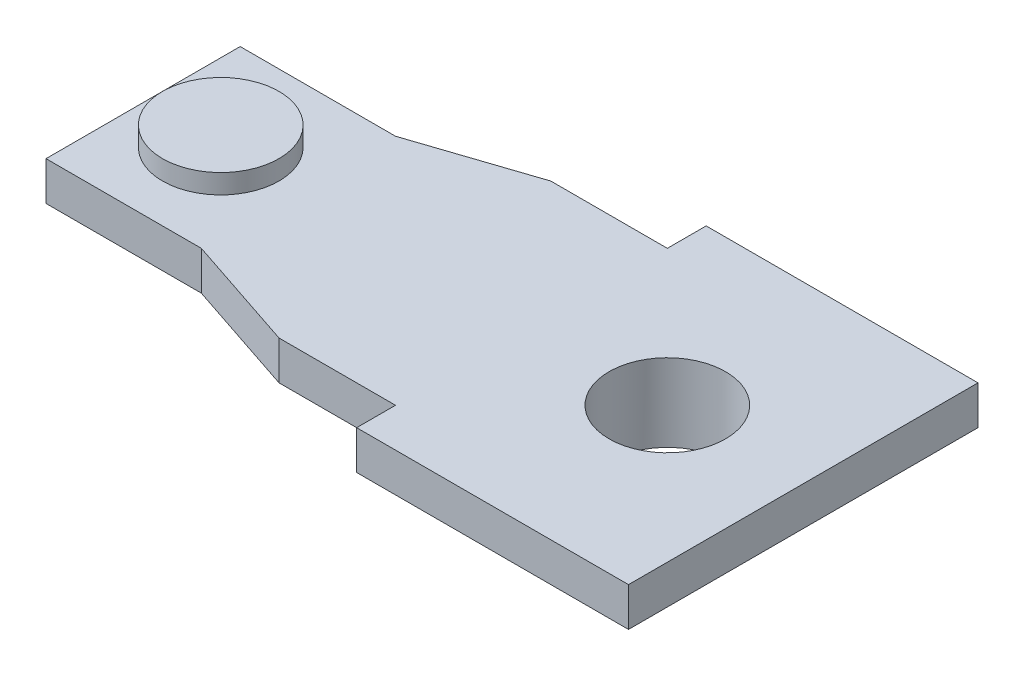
ISO-10303-21;
HEADER;
FILE_DESCRIPTION(('STEP AP214'),'2;1');
FILE_NAME('part.step','',(''),(''),'','','');
FILE_SCHEMA(('AUTOMOTIVE_DESIGN { 1 0 10303 214 1 1 1 1 }'));
ENDSEC;
DATA;
#1=APPLICATION_CONTEXT('core data for automotive mechanical design processes');
#2=APPLICATION_PROTOCOL_DEFINITION('international standard','automotive_design',2000,#1);
#3=PRODUCT_CONTEXT('',#1,'mechanical');
#4=PRODUCT('Part','Part','',(#3));
#5=PRODUCT_RELATED_PRODUCT_CATEGORY('part','',(#4));
#6=PRODUCT_DEFINITION_FORMATION('','',#4);
#7=PRODUCT_DEFINITION_CONTEXT('part definition',#1,'design');
#8=PRODUCT_DEFINITION('design','',#6,#7);
#9=PRODUCT_DEFINITION_SHAPE('','',#8);
#10=(LENGTH_UNIT() NAMED_UNIT(*) SI_UNIT(.MILLI.,.METRE.));
#11=(NAMED_UNIT(*) PLANE_ANGLE_UNIT() SI_UNIT($,.RADIAN.));
#12=(NAMED_UNIT(*) SI_UNIT($,.STERADIAN.) SOLID_ANGLE_UNIT());
#13=UNCERTAINTY_MEASURE_WITH_UNIT(LENGTH_MEASURE(1.E-05),#10,'distance_accuracy_value','');
#14=(GEOMETRIC_REPRESENTATION_CONTEXT(3) GLOBAL_UNCERTAINTY_ASSIGNED_CONTEXT((#13)) GLOBAL_UNIT_ASSIGNED_CONTEXT((#10,
#11,#12)) REPRESENTATION_CONTEXT('',''));
#15=CARTESIAN_POINT('',(0.,0.,0.));
#16=DIRECTION('',(0.,0.,1.));
#17=DIRECTION('',(1.,0.,0.));
#18=AXIS2_PLACEMENT_3D('',#15,#16,#17);
#19=CARTESIAN_POINT('',(-3.5,1.,4.5));
#20=DIRECTION('',(0.,1.,0.));
#21=DIRECTION('',(0.,0.,1.));
#22=AXIS2_PLACEMENT_3D('',#19,#20,#21);
#23=PLANE('',#22);
#24=DIRECTION('',(0.,0.,1.));
#25=VECTOR('',#24,1.);
#26=CARTESIAN_POINT('',(-3.5,1.,-4.5));
#27=LINE('',#26,#25);
#28=CARTESIAN_POINT('',(-3.5,1.,-4.5));
#29=VERTEX_POINT('',#28);
#30=CARTESIAN_POINT('',(-3.5,1.,-3.5));
#31=VERTEX_POINT('',#30);
#32=EDGE_CURVE('E138',#29,#31,#27,.T.);
#33=ORIENTED_EDGE('',*,*,#32,.T.);
#34=DIRECTION('',(-1.,0.,0.));
#35=VECTOR('',#34,1.);
#36=CARTESIAN_POINT('',(-3.5,1.,-3.5));
#37=LINE('',#36,#35);
#38=CARTESIAN_POINT('',(-6.5,1.,-3.5));
#39=VERTEX_POINT('',#38);
#40=EDGE_CURVE('E45',#31,#39,#37,.T.);
#41=ORIENTED_EDGE('',*,*,#40,.T.);
#42=DIRECTION('',(-0.948683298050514,0.,0.316227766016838));
#43=VECTOR('',#42,1.);
#44=CARTESIAN_POINT('',(-6.5,1.,-3.5));
#45=LINE('',#44,#43);
#46=CARTESIAN_POINT('',(-9.5,1.,-2.5));
#47=VERTEX_POINT('',#46);
#48=EDGE_CURVE('E130',#39,#47,#45,.T.);
#49=ORIENTED_EDGE('',*,*,#48,.T.);
#50=DIRECTION('',(-1.,0.,0.));
#51=VECTOR('',#50,1.);
#52=CARTESIAN_POINT('',(-9.5,1.,-2.5));
#53=LINE('',#52,#51);
#54=CARTESIAN_POINT('',(-13.5,1.,-2.5));
#55=VERTEX_POINT('',#54);
#56=EDGE_CURVE('E134',#47,#55,#53,.T.);
#57=ORIENTED_EDGE('',*,*,#56,.T.);
#58=DIRECTION('',(0.,0.,1.));
#59=VECTOR('',#58,1.);
#60=CARTESIAN_POINT('',(-13.5,1.,2.5));
#61=LINE('',#60,#59);
#62=CARTESIAN_POINT('',(-13.5,1.,2.5));
#63=VERTEX_POINT('',#62);
#64=EDGE_CURVE('E297',#55,#63,#61,.T.);
#65=ORIENTED_EDGE('',*,*,#64,.T.);
#66=DIRECTION('',(1.,0.,0.));
#67=VECTOR('',#66,1.);
#68=CARTESIAN_POINT('',(-9.5,1.,2.5));
#69=LINE('',#68,#67);
#70=CARTESIAN_POINT('',(-9.5,1.,2.5));
#71=VERTEX_POINT('',#70);
#72=EDGE_CURVE('E300',#63,#71,#69,.T.);
#73=ORIENTED_EDGE('',*,*,#72,.T.);
#74=DIRECTION('',(0.948683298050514,0.,0.316227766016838));
#75=VECTOR('',#74,1.);
#76=CARTESIAN_POINT('',(-6.5,1.,3.5));
#77=LINE('',#76,#75);
#78=CARTESIAN_POINT('',(-6.5,1.,3.5));
#79=VERTEX_POINT('',#78);
#80=EDGE_CURVE('E303',#71,#79,#77,.T.);
#81=ORIENTED_EDGE('',*,*,#80,.T.);
#82=DIRECTION('',(1.,0.,0.));
#83=VECTOR('',#82,1.);
#84=CARTESIAN_POINT('',(-3.5,1.,3.5));
#85=LINE('',#84,#83);
#86=CARTESIAN_POINT('',(-3.5,1.,3.5));
#87=VERTEX_POINT('',#86);
#88=EDGE_CURVE('E306',#79,#87,#85,.T.);
#89=ORIENTED_EDGE('',*,*,#88,.T.);
#90=CARTESIAN_POINT('',(-3.5,1.,4.5));
#91=VERTEX_POINT('',#90);
#92=EDGE_CURVE('E146',#87,#91,#27,.T.);
#93=ORIENTED_EDGE('',*,*,#92,.T.);
#94=DIRECTION('',(1.,0.,0.));
#95=VECTOR('',#94,1.);
#96=CARTESIAN_POINT('',(-3.5,1.,4.5));
#97=LINE('',#96,#95);
#98=CARTESIAN_POINT('',(3.5,1.,4.5));
#99=VERTEX_POINT('',#98);
#100=EDGE_CURVE('E196',#91,#99,#97,.T.);
#101=ORIENTED_EDGE('',*,*,#100,.T.);
#102=DIRECTION('',(0.,0.,-1.));
#103=VECTOR('',#102,1.);
#104=CARTESIAN_POINT('',(3.5,1.,-4.5));
#105=LINE('',#104,#103);
#106=CARTESIAN_POINT('',(3.5,1.,-4.5));
#107=VERTEX_POINT('',#106);
#108=EDGE_CURVE('E194',#99,#107,#105,.T.);
#109=ORIENTED_EDGE('',*,*,#108,.T.);
#110=DIRECTION('',(-1.,0.,0.));
#111=VECTOR('',#110,1.);
#112=CARTESIAN_POINT('',(-3.5,1.,-4.5));
#113=LINE('',#112,#111);
#114=EDGE_CURVE('E53',#107,#29,#113,.T.);
#115=ORIENTED_EDGE('',*,*,#114,.T.);
#116=EDGE_LOOP('',(#33,#41,#49,#57,#65,#73,#81,#89,#93,#101,#109,#115));
#117=FACE_BOUND('',#116,.T.);
#118=CARTESIAN_POINT('',(0.,1.,0.));
#119=DIRECTION('',(0.,1.,0.));
#120=DIRECTION('',(0.,0.,1.));
#121=AXIS2_PLACEMENT_3D('',#118,#119,#120);
#122=CIRCLE('',#121,1.5);
#123=CARTESIAN_POINT('',(0.,1.,1.5));
#124=VERTEX_POINT('',#123);
#125=EDGE_CURVE('E165',#124,#124,#122,.T.);
#126=ORIENTED_EDGE('',*,*,#125,.F.);
#127=EDGE_LOOP('',(#126));
#128=FACE_BOUND('',#127,.T.);
#129=CARTESIAN_POINT('',(-11.5,1.,0.));
#130=DIRECTION('',(0.,1.,0.));
#131=DIRECTION('',(0.,0.,1.));
#132=AXIS2_PLACEMENT_3D('',#129,#130,#131);
#133=CIRCLE('',#132,1.5);
#134=CARTESIAN_POINT('',(-11.5,1.,1.5));
#135=VERTEX_POINT('',#134);
#136=EDGE_CURVE('E142',#135,#135,#133,.T.);
#137=ORIENTED_EDGE('',*,*,#136,.F.);
#138=EDGE_LOOP('',(#137));
#139=FACE_BOUND('',#138,.T.);
#140=ADVANCED_FACE('F28',(#117,#128,#139),#23,.T.);
#141=CARTESIAN_POINT('',(-3.5,1.,-4.5));
#142=DIRECTION('',(1.,0.,0.));
#143=DIRECTION('',(0.,0.,-1.));
#144=AXIS2_PLACEMENT_3D('',#141,#142,#143);
#145=PLANE('',#144);
#146=DIRECTION('',(0.,1.,0.));
#147=VECTOR('',#146,1.);
#148=CARTESIAN_POINT('',(-3.5,0.,3.5));
#149=LINE('',#148,#147);
#150=CARTESIAN_POINT('',(-3.5,0.,3.5));
#151=VERTEX_POINT('',#150);
#152=EDGE_CURVE('E162',#151,#87,#149,.T.);
#153=ORIENTED_EDGE('',*,*,#152,.F.);
#154=DIRECTION('',(0.,0.,1.));
#155=VECTOR('',#154,1.);
#156=CARTESIAN_POINT('',(-3.5,0.,-4.5));
#157=LINE('',#156,#155);
#158=CARTESIAN_POINT('',(-3.5,0.,4.5));
#159=VERTEX_POINT('',#158);
#160=EDGE_CURVE('E168',#151,#159,#157,.T.);
#161=ORIENTED_EDGE('',*,*,#160,.T.);
#162=DIRECTION('',(0.,-1.,0.));
#163=VECTOR('',#162,1.);
#164=CARTESIAN_POINT('',(-3.5,1.,4.5));
#165=LINE('',#164,#163);
#166=EDGE_CURVE('E181',#91,#159,#165,.T.);
#167=ORIENTED_EDGE('',*,*,#166,.F.);
#168=ORIENTED_EDGE('',*,*,#92,.F.);
#169=EDGE_LOOP('',(#153,#161,#167,#168));
#170=FACE_BOUND('',#169,.T.);
#171=ADVANCED_FACE('F236',(#170),#145,.F.);
#172=CARTESIAN_POINT('',(-3.5,0.,4.5));
#173=DIRECTION('',(0.,1.,0.));
#174=DIRECTION('',(0.,0.,1.));
#175=AXIS2_PLACEMENT_3D('',#172,#173,#174);
#176=PLANE('',#175);
#177=CARTESIAN_POINT('',(0.,0.,0.));
#178=DIRECTION('',(0.,1.,0.));
#179=DIRECTION('',(0.,0.,1.));
#180=AXIS2_PLACEMENT_3D('',#177,#178,#179);
#181=CIRCLE('',#180,3.);
#182=CARTESIAN_POINT('',(0.,0.,3.));
#183=VERTEX_POINT('',#182);
#184=EDGE_CURVE('E11',#183,#183,#181,.T.);
#185=ORIENTED_EDGE('',*,*,#184,.T.);
#186=EDGE_LOOP('',(#185));
#187=FACE_BOUND('',#186,.T.);
#188=CARTESIAN_POINT('',(-3.5,0.,-4.5));
#189=VERTEX_POINT('',#188);
#190=CARTESIAN_POINT('',(-3.5,0.,-3.5));
#191=VERTEX_POINT('',#190);
#192=EDGE_CURVE('E176',#189,#191,#157,.T.);
#193=ORIENTED_EDGE('',*,*,#192,.F.);
#194=DIRECTION('',(-1.,0.,0.));
#195=VECTOR('',#194,1.);
#196=CARTESIAN_POINT('',(-3.5,0.,-4.5));
#197=LINE('',#196,#195);
#198=CARTESIAN_POINT('',(3.5,0.,-4.5));
#199=VERTEX_POINT('',#198);
#200=EDGE_CURVE('E199',#199,#189,#197,.T.);
#201=ORIENTED_EDGE('',*,*,#200,.F.);
#202=DIRECTION('',(0.,0.,-1.));
#203=VECTOR('',#202,1.);
#204=CARTESIAN_POINT('',(3.5,0.,-4.5));
#205=LINE('',#204,#203);
#206=CARTESIAN_POINT('',(3.5,0.,4.5));
#207=VERTEX_POINT('',#206);
#208=EDGE_CURVE('E204',#207,#199,#205,.T.);
#209=ORIENTED_EDGE('',*,*,#208,.F.);
#210=DIRECTION('',(1.,0.,0.));
#211=VECTOR('',#210,1.);
#212=CARTESIAN_POINT('',(-3.5,0.,4.5));
#213=LINE('',#212,#211);
#214=EDGE_CURVE('E171',#159,#207,#213,.T.);
#215=ORIENTED_EDGE('',*,*,#214,.F.);
#216=ORIENTED_EDGE('',*,*,#160,.F.);
#217=DIRECTION('',(1.,0.,0.));
#218=VECTOR('',#217,1.);
#219=CARTESIAN_POINT('',(-3.5,0.,3.5));
#220=LINE('',#219,#218);
#221=CARTESIAN_POINT('',(-6.5,0.,3.5));
#222=VERTEX_POINT('',#221);
#223=EDGE_CURVE('E153',#222,#151,#220,.T.);
#224=ORIENTED_EDGE('',*,*,#223,.F.);
#225=DIRECTION('',(0.948683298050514,0.,0.316227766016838));
#226=VECTOR('',#225,1.);
#227=CARTESIAN_POINT('',(-6.5,0.,3.5));
#228=LINE('',#227,#226);
#229=CARTESIAN_POINT('',(-9.5,0.,2.5));
#230=VERTEX_POINT('',#229);
#231=EDGE_CURVE('E318',#230,#222,#228,.T.);
#232=ORIENTED_EDGE('',*,*,#231,.F.);
#233=DIRECTION('',(1.,0.,0.));
#234=VECTOR('',#233,1.);
#235=CARTESIAN_POINT('',(-9.5,0.,2.5));
#236=LINE('',#235,#234);
#237=CARTESIAN_POINT('',(-13.5,0.,2.5));
#238=VERTEX_POINT('',#237);
#239=EDGE_CURVE('E315',#238,#230,#236,.T.);
#240=ORIENTED_EDGE('',*,*,#239,.F.);
#241=DIRECTION('',(0.,0.,1.));
#242=VECTOR('',#241,1.);
#243=CARTESIAN_POINT('',(-13.5,0.,2.5));
#244=LINE('',#243,#242);
#245=CARTESIAN_POINT('',(-13.5,0.,-2.5));
#246=VERTEX_POINT('',#245);
#247=EDGE_CURVE('E312',#246,#238,#244,.T.);
#248=ORIENTED_EDGE('',*,*,#247,.F.);
#249=DIRECTION('',(-1.,0.,0.));
#250=VECTOR('',#249,1.);
#251=CARTESIAN_POINT('',(-9.5,0.,-2.5));
#252=LINE('',#251,#250);
#253=CARTESIAN_POINT('',(-9.5,0.,-2.5));
#254=VERTEX_POINT('',#253);
#255=EDGE_CURVE('E309',#254,#246,#252,.T.);
#256=ORIENTED_EDGE('',*,*,#255,.F.);
#257=DIRECTION('',(-0.948683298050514,0.,0.316227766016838));
#258=VECTOR('',#257,1.);
#259=CARTESIAN_POINT('',(-6.5,0.,-3.5));
#260=LINE('',#259,#258);
#261=CARTESIAN_POINT('',(-6.5,0.,-3.5));
#262=VERTEX_POINT('',#261);
#263=EDGE_CURVE('E307',#262,#254,#260,.T.);
#264=ORIENTED_EDGE('',*,*,#263,.F.);
#265=DIRECTION('',(-1.,0.,0.));
#266=VECTOR('',#265,1.);
#267=CARTESIAN_POINT('',(-3.5,0.,-3.5));
#268=LINE('',#267,#266);
#269=EDGE_CURVE('E122',#191,#262,#268,.T.);
#270=ORIENTED_EDGE('',*,*,#269,.F.);
#271=EDGE_LOOP('',(#193,#201,#209,#215,#216,#224,#232,#240,#248,#256,#264,#270));
#272=FACE_BOUND('',#271,.T.);
#273=ADVANCED_FACE('F220',(#187,#272),#176,.F.);
#274=ORIENTED_EDGE('',*,*,#192,.T.);
#275=DIRECTION('',(0.,1.,0.));
#276=VECTOR('',#275,1.);
#277=CARTESIAN_POINT('',(-3.5,0.,-3.5));
#278=LINE('',#277,#276);
#279=EDGE_CURVE('E127',#191,#31,#278,.T.);
#280=ORIENTED_EDGE('',*,*,#279,.T.);
#281=ORIENTED_EDGE('',*,*,#32,.F.);
#282=DIRECTION('',(0.,-1.,0.));
#283=VECTOR('',#282,1.);
#284=CARTESIAN_POINT('',(-3.5,1.,-4.5));
#285=LINE('',#284,#283);
#286=EDGE_CURVE('E190',#29,#189,#285,.T.);
#287=ORIENTED_EDGE('',*,*,#286,.T.);
#288=EDGE_LOOP('',(#274,#280,#281,#287));
#289=FACE_BOUND('',#288,.T.);
#290=ADVANCED_FACE('F30',(#289),#145,.F.);
#291=CARTESIAN_POINT('',(-3.5,1.,4.5));
#292=DIRECTION('',(0.,0.,-1.));
#293=DIRECTION('',(-1.,0.,0.));
#294=AXIS2_PLACEMENT_3D('',#291,#292,#293);
#295=PLANE('',#294);
#296=ORIENTED_EDGE('',*,*,#214,.T.);
#297=DIRECTION('',(0.,-1.,0.));
#298=VECTOR('',#297,1.);
#299=CARTESIAN_POINT('',(3.5,1.,4.5));
#300=LINE('',#299,#298);
#301=EDGE_CURVE('E184',#99,#207,#300,.T.);
#302=ORIENTED_EDGE('',*,*,#301,.F.);
#303=ORIENTED_EDGE('',*,*,#100,.F.);
#304=ORIENTED_EDGE('',*,*,#166,.T.);
#305=EDGE_LOOP('',(#296,#302,#303,#304));
#306=FACE_BOUND('',#305,.T.);
#307=ADVANCED_FACE('F213',(#306),#295,.F.);
#308=CARTESIAN_POINT('',(3.5,1.,-4.5));
#309=DIRECTION('',(-1.,0.,0.));
#310=DIRECTION('',(0.,0.,1.));
#311=AXIS2_PLACEMENT_3D('',#308,#309,#310);
#312=PLANE('',#311);
#313=ORIENTED_EDGE('',*,*,#208,.T.);
#314=DIRECTION('',(0.,-1.,0.));
#315=VECTOR('',#314,1.);
#316=CARTESIAN_POINT('',(3.5,1.,-4.5));
#317=LINE('',#316,#315);
#318=EDGE_CURVE('E187',#107,#199,#317,.T.);
#319=ORIENTED_EDGE('',*,*,#318,.F.);
#320=ORIENTED_EDGE('',*,*,#108,.F.);
#321=ORIENTED_EDGE('',*,*,#301,.T.);
#322=EDGE_LOOP('',(#313,#319,#320,#321));
#323=FACE_BOUND('',#322,.T.);
#324=ADVANCED_FACE('F218',(#323),#312,.F.);
#325=CARTESIAN_POINT('',(-3.5,1.,-4.5));
#326=DIRECTION('',(0.,0.,1.));
#327=DIRECTION('',(1.,0.,0.));
#328=AXIS2_PLACEMENT_3D('',#325,#326,#327);
#329=PLANE('',#328);
#330=ORIENTED_EDGE('',*,*,#200,.T.);
#331=ORIENTED_EDGE('',*,*,#286,.F.);
#332=ORIENTED_EDGE('',*,*,#114,.F.);
#333=ORIENTED_EDGE('',*,*,#318,.T.);
#334=EDGE_LOOP('',(#330,#331,#332,#333));
#335=FACE_BOUND('',#334,.T.);
#336=ADVANCED_FACE('F222',(#335),#329,.F.);
#337=CARTESIAN_POINT('',(0.,0.,0.));
#338=DIRECTION('',(0.,1.,0.));
#339=DIRECTION('',(0.,0.,1.));
#340=AXIS2_PLACEMENT_3D('',#337,#338,#339);
#341=CYLINDRICAL_SURFACE('',#340,1.5);
#342=ORIENTED_EDGE('',*,*,#125,.T.);
#343=EDGE_LOOP('',(#342));
#344=FACE_BOUND('',#343,.T.);
#345=CARTESIAN_POINT('',(0.,-1.,0.));
#346=DIRECTION('',(0.,-1.,0.));
#347=DIRECTION('',(0.,0.,-1.));
#348=AXIS2_PLACEMENT_3D('',#345,#346,#347);
#349=CIRCLE('',#348,1.5);
#350=CARTESIAN_POINT('',(0.,-1.,-1.5));
#351=VERTEX_POINT('',#350);
#352=EDGE_CURVE('E158',#351,#351,#349,.T.);
#353=ORIENTED_EDGE('',*,*,#352,.T.);
#354=EDGE_LOOP('',(#353));
#355=FACE_BOUND('',#354,.T.);
#356=ADVANCED_FACE('F224',(#344,#355),#341,.F.);
#357=CARTESIAN_POINT('',(0.,-1.,0.));
#358=DIRECTION('',(0.,-1.,0.));
#359=DIRECTION('',(0.,0.,-1.));
#360=AXIS2_PLACEMENT_3D('',#357,#358,#359);
#361=PLANE('',#360);
#362=CARTESIAN_POINT('',(0.,-1.,0.));
#363=DIRECTION('',(0.,-1.,0.));
#364=DIRECTION('',(0.,0.,-1.));
#365=AXIS2_PLACEMENT_3D('',#362,#363,#364);
#366=CIRCLE('',#365,2.5);
#367=CARTESIAN_POINT('',(0.,-1.,-2.5));
#368=VERTEX_POINT('',#367);
#369=EDGE_CURVE('E161',#368,#368,#366,.T.);
#370=ORIENTED_EDGE('',*,*,#369,.T.);
#371=EDGE_LOOP('',(#370));
#372=FACE_BOUND('',#371,.T.);
#373=ORIENTED_EDGE('',*,*,#352,.F.);
#374=EDGE_LOOP('',(#373));
#375=FACE_BOUND('',#374,.T.);
#376=ADVANCED_FACE('F230',(#372,#375),#361,.T.);
#377=CARTESIAN_POINT('',(0.,-1.,0.));
#378=DIRECTION('',(0.,1.,0.));
#379=DIRECTION('',(0.,0.,1.));
#380=AXIS2_PLACEMENT_3D('',#377,#378,#379);
#381=CYLINDRICAL_SURFACE('',#380,2.5);
#382=CARTESIAN_POINT('',(0.,-0.5,0.));
#383=DIRECTION('',(0.,1.,0.));
#384=DIRECTION('',(0.,0.,1.));
#385=AXIS2_PLACEMENT_3D('',#382,#383,#384);
#386=CIRCLE('',#385,2.5);
#387=CARTESIAN_POINT('',(0.,-0.5,2.5));
#388=VERTEX_POINT('',#387);
#389=EDGE_CURVE('E37',#388,#388,#386,.F.);
#390=ORIENTED_EDGE('',*,*,#389,.T.);
#391=EDGE_LOOP('',(#390));
#392=FACE_BOUND('',#391,.T.);
#393=ORIENTED_EDGE('',*,*,#369,.F.);
#394=EDGE_LOOP('',(#393));
#395=FACE_BOUND('',#394,.T.);
#396=ADVANCED_FACE('F247',(#392,#395),#381,.T.);
#397=CARTESIAN_POINT('',(0.,-0.5,0.));
#398=DIRECTION('',(0.,1.,0.));
#399=DIRECTION('',(0.,0.,1.));
#400=AXIS2_PLACEMENT_3D('',#397,#398,#399);
#401=TOROIDAL_SURFACE('',#400,3.,0.5);
#402=ORIENTED_EDGE('',*,*,#184,.F.);
#403=EDGE_LOOP('',(#402));
#404=FACE_BOUND('',#403,.T.);
#405=ORIENTED_EDGE('',*,*,#389,.F.);
#406=EDGE_LOOP('',(#405));
#407=FACE_BOUND('',#406,.T.);
#408=ADVANCED_FACE('F250',(#404,#407),#401,.F.);
#409=CARTESIAN_POINT('',(-3.5,0.,3.5));
#410=DIRECTION('',(0.,0.,1.));
#411=DIRECTION('',(1.,0.,0.));
#412=AXIS2_PLACEMENT_3D('',#409,#410,#411);
#413=PLANE('',#412);
#414=ORIENTED_EDGE('',*,*,#88,.F.);
#415=DIRECTION('',(0.,1.,0.));
#416=VECTOR('',#415,1.);
#417=CARTESIAN_POINT('',(-6.5,0.,3.5));
#418=LINE('',#417,#416);
#419=EDGE_CURVE('E323',#222,#79,#418,.T.);
#420=ORIENTED_EDGE('',*,*,#419,.F.);
#421=ORIENTED_EDGE('',*,*,#223,.T.);
#422=ORIENTED_EDGE('',*,*,#152,.T.);
#423=EDGE_LOOP('',(#414,#420,#421,#422));
#424=FACE_BOUND('',#423,.T.);
#425=ADVANCED_FACE('F257',(#424),#413,.T.);
#426=CARTESIAN_POINT('',(-6.5,0.,3.5));
#427=DIRECTION('',(-0.316227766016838,0.,0.948683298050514));
#428=DIRECTION('',(0.948683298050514,0.,0.316227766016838));
#429=AXIS2_PLACEMENT_3D('',#426,#427,#428);
#430=PLANE('',#429);
#431=ORIENTED_EDGE('',*,*,#80,.F.);
#432=DIRECTION('',(0.,1.,0.));
#433=VECTOR('',#432,1.);
#434=CARTESIAN_POINT('',(-9.5,0.,2.5));
#435=LINE('',#434,#433);
#436=EDGE_CURVE('E336',#230,#71,#435,.T.);
#437=ORIENTED_EDGE('',*,*,#436,.F.);
#438=ORIENTED_EDGE('',*,*,#231,.T.);
#439=ORIENTED_EDGE('',*,*,#419,.T.);
#440=EDGE_LOOP('',(#431,#437,#438,#439));
#441=FACE_BOUND('',#440,.T.);
#442=ADVANCED_FACE('F274',(#441),#430,.T.);
#443=CARTESIAN_POINT('',(-9.5,0.,2.5));
#444=DIRECTION('',(0.,0.,1.));
#445=DIRECTION('',(1.,0.,0.));
#446=AXIS2_PLACEMENT_3D('',#443,#444,#445);
#447=PLANE('',#446);
#448=ORIENTED_EDGE('',*,*,#72,.F.);
#449=DIRECTION('',(0.,1.,0.));
#450=VECTOR('',#449,1.);
#451=CARTESIAN_POINT('',(-13.5,0.,2.5));
#452=LINE('',#451,#450);
#453=EDGE_CURVE('E338',#238,#63,#452,.T.);
#454=ORIENTED_EDGE('',*,*,#453,.F.);
#455=ORIENTED_EDGE('',*,*,#239,.T.);
#456=ORIENTED_EDGE('',*,*,#436,.T.);
#457=EDGE_LOOP('',(#448,#454,#455,#456));
#458=FACE_BOUND('',#457,.T.);
#459=ADVANCED_FACE('F270',(#458),#447,.T.);
#460=CARTESIAN_POINT('',(-13.5,0.,2.5));
#461=DIRECTION('',(-1.,0.,0.));
#462=DIRECTION('',(0.,0.,1.));
#463=AXIS2_PLACEMENT_3D('',#460,#461,#462);
#464=PLANE('',#463);
#465=ORIENTED_EDGE('',*,*,#64,.F.);
#466=DIRECTION('',(0.,1.,0.));
#467=VECTOR('',#466,1.);
#468=CARTESIAN_POINT('',(-13.5,0.,-2.5));
#469=LINE('',#468,#467);
#470=EDGE_CURVE('E339',#246,#55,#469,.T.);
#471=ORIENTED_EDGE('',*,*,#470,.F.);
#472=ORIENTED_EDGE('',*,*,#247,.T.);
#473=ORIENTED_EDGE('',*,*,#453,.T.);
#474=EDGE_LOOP('',(#465,#471,#472,#473));
#475=FACE_BOUND('',#474,.T.);
#476=ADVANCED_FACE('F266',(#475),#464,.T.);
#477=CARTESIAN_POINT('',(-9.5,0.,-2.5));
#478=DIRECTION('',(0.,0.,-1.));
#479=DIRECTION('',(-1.,0.,0.));
#480=AXIS2_PLACEMENT_3D('',#477,#478,#479);
#481=PLANE('',#480);
#482=ORIENTED_EDGE('',*,*,#56,.F.);
#483=DIRECTION('',(0.,1.,0.));
#484=VECTOR('',#483,1.);
#485=CARTESIAN_POINT('',(-9.5,0.,-2.5));
#486=LINE('',#485,#484);
#487=EDGE_CURVE('E126',#254,#47,#486,.T.);
#488=ORIENTED_EDGE('',*,*,#487,.F.);
#489=ORIENTED_EDGE('',*,*,#255,.T.);
#490=ORIENTED_EDGE('',*,*,#470,.T.);
#491=EDGE_LOOP('',(#482,#488,#489,#490));
#492=FACE_BOUND('',#491,.T.);
#493=ADVANCED_FACE('F263',(#492),#481,.T.);
#494=CARTESIAN_POINT('',(-6.5,0.,-3.5));
#495=DIRECTION('',(-0.316227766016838,0.,-0.948683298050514));
#496=DIRECTION('',(-0.948683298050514,0.,0.316227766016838));
#497=AXIS2_PLACEMENT_3D('',#494,#495,#496);
#498=PLANE('',#497);
#499=ORIENTED_EDGE('',*,*,#48,.F.);
#500=DIRECTION('',(0.,1.,0.));
#501=VECTOR('',#500,1.);
#502=CARTESIAN_POINT('',(-6.5,0.,-3.5));
#503=LINE('',#502,#501);
#504=EDGE_CURVE('E118',#262,#39,#503,.T.);
#505=ORIENTED_EDGE('',*,*,#504,.F.);
#506=ORIENTED_EDGE('',*,*,#263,.T.);
#507=ORIENTED_EDGE('',*,*,#487,.T.);
#508=EDGE_LOOP('',(#499,#505,#506,#507));
#509=FACE_BOUND('',#508,.T.);
#510=ADVANCED_FACE('F131',(#509),#498,.T.);
#511=CARTESIAN_POINT('',(-3.5,0.,-3.5));
#512=DIRECTION('',(0.,0.,-1.));
#513=DIRECTION('',(-1.,0.,0.));
#514=AXIS2_PLACEMENT_3D('',#511,#512,#513);
#515=PLANE('',#514);
#516=ORIENTED_EDGE('',*,*,#40,.F.);
#517=ORIENTED_EDGE('',*,*,#279,.F.);
#518=ORIENTED_EDGE('',*,*,#269,.T.);
#519=ORIENTED_EDGE('',*,*,#504,.T.);
#520=EDGE_LOOP('',(#516,#517,#518,#519));
#521=FACE_BOUND('',#520,.T.);
#522=ADVANCED_FACE('F120',(#521),#515,.T.);
#523=CARTESIAN_POINT('',(-11.5,1.5,0.));
#524=DIRECTION('',(0.,-1.,0.));
#525=DIRECTION('',(0.,0.,-1.));
#526=AXIS2_PLACEMENT_3D('',#523,#524,#525);
#527=CYLINDRICAL_SURFACE('',#526,1.5);
#528=CARTESIAN_POINT('',(-11.5,1.5,0.));
#529=DIRECTION('',(0.,1.,0.));
#530=DIRECTION('',(0.,0.,1.));
#531=AXIS2_PLACEMENT_3D('',#528,#529,#530);
#532=CIRCLE('',#531,1.5);
#533=CARTESIAN_POINT('',(-11.5,1.5,1.5));
#534=VERTEX_POINT('',#533);
#535=EDGE_CURVE('E139',#534,#534,#532,.T.);
#536=ORIENTED_EDGE('',*,*,#535,.F.);
#537=EDGE_LOOP('',(#536));
#538=FACE_BOUND('',#537,.T.);
#539=ORIENTED_EDGE('',*,*,#136,.T.);
#540=EDGE_LOOP('',(#539));
#541=FACE_BOUND('',#540,.T.);
#542=ADVANCED_FACE('F260',(#538,#541),#527,.T.);
#543=CARTESIAN_POINT('',(-11.5,1.5,0.));
#544=DIRECTION('',(0.,1.,0.));
#545=DIRECTION('',(0.,0.,1.));
#546=AXIS2_PLACEMENT_3D('',#543,#544,#545);
#547=PLANE('',#546);
#548=ORIENTED_EDGE('',*,*,#535,.T.);
#549=EDGE_LOOP('',(#548));
#550=FACE_BOUND('',#549,.T.);
#551=ADVANCED_FACE('F283',(#550),#547,.T.);
#552=CLOSED_SHELL('',(#140,#171,#273,#290,#307,#324,#336,#356,#376,#396,#408,#425,#442,#459,
#476,#493,#510,#522,#542,#551));
#553=MANIFOLD_SOLID_BREP('B2',#552);
#554=ADVANCED_BREP_SHAPE_REPRESENTATION('',(#18,#553),#14);
#555=SHAPE_DEFINITION_REPRESENTATION(#9,#554);
ENDSEC;
END-ISO-10303-21;
